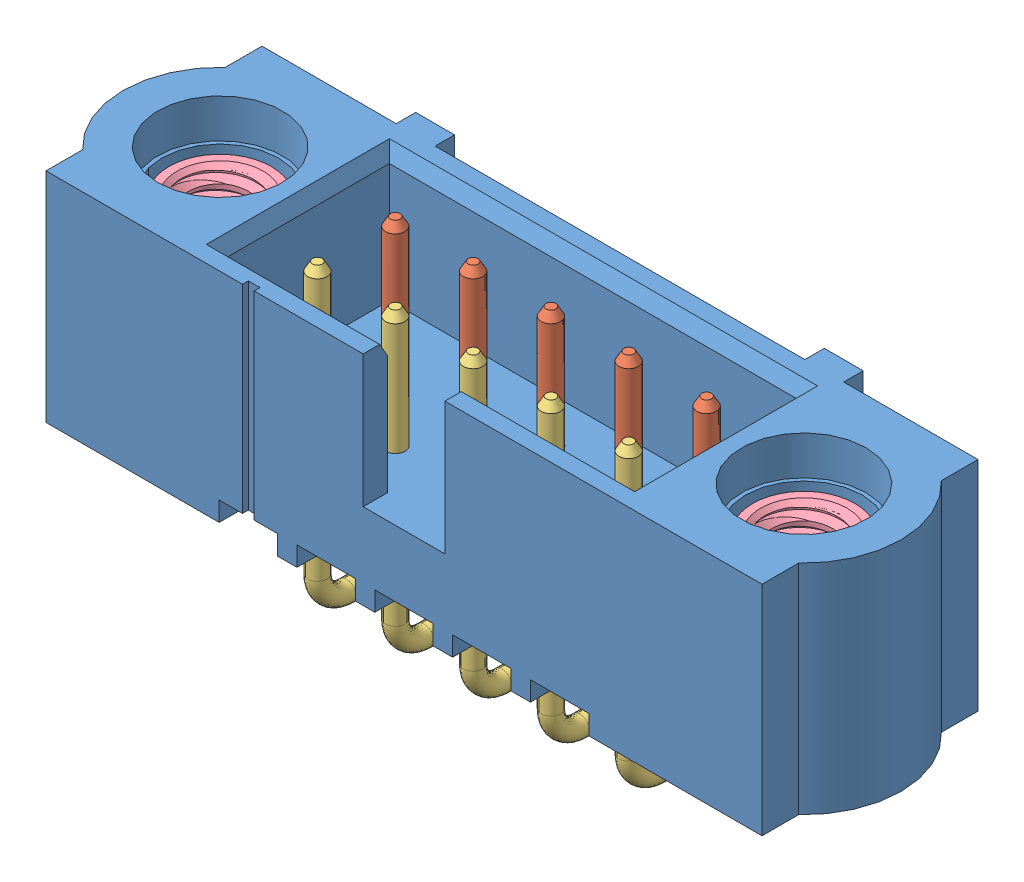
SolidWorks assembly m80-5301042_asm.SLDASM, configuration Default (file format 8000). Lengths in mm.
Overall size (20 8.25 9.06).
13 component instances, 4 part files, 0 mates.
Components (placement in the parent):
- M80-2702098_SEPARATE_ROWS-1: M80-2702098_SEPARATE_ROWS.sldprt [Default] at origin size (20 5.6 6.05)
- M80-530XX22_SHORT_PIN-1: M80-530XX22_SHORT_PIN.sldprt [Default] at (-4 -2.6 -1) x (0 -1 0) z (-1 0 0) size (5.95 5.68 0.8)
- M80-530XX22_SHORT_PIN-2: M80-530XX22_SHORT_PIN.sldprt [Default] at (-2 -2.6 -1) x (0 -1 0) z (-1 0 0) size (5.95 5.68 0.8)
- M80-530XX22_SHORT_PIN-3: M80-530XX22_SHORT_PIN.sldprt [Default] at (0 -2.6 -1) x (0 -1 0) z (-1 0 0) size (5.95 5.68 0.8)
- M80-530XX22_SHORT_PIN-4: M80-530XX22_SHORT_PIN.sldprt [Default] at (2 -2.6 -1) x (0 -1 0) z (-1 0 0) size (5.95 5.68 0.8)
- M80-530XX22_SHORT_PIN-5: M80-530XX22_SHORT_PIN.sldprt [Default] at (4 -2.6 -1) x (0 -1 0) z (-1 0 0) size (5.95 5.68 0.8)
- M80-530XX22_LONG_PIN-1: M80-530XX22_LONG_PIN.sldprt [Default] at (-4 -4.6 1) x (0 -1 0) z (-1 0 0) size (7.95 7.68 0.8)
- M80-530XX22_LONG_PIN-2: M80-530XX22_LONG_PIN.sldprt [Default] at (-2 -4.6 1) x (0 -1 0) z (-1 0 0) size (7.95 7.68 0.8)
- M80-530XX22_LONG_PIN-3: M80-530XX22_LONG_PIN.sldprt [Default] at (0 -4.6 1) x (0 -1 0) z (-1 0 0) size (7.95 7.68 0.8)
- M80-530XX22_LONG_PIN-4: M80-530XX22_LONG_PIN.sldprt [Default] at (2 -4.6 1) x (0 -1 0) z (-1 0 0) size (7.95 7.68 0.8)
- M80-530XX22_LONG_PIN-5: M80-530XX22_LONG_PIN.sldprt [Default] at (4 -4.6 1) x (0 -1 0) z (-1 0 0) size (7.95 7.68 0.8)
- M80-210-1: M80-210.sldprt [Default] at (7.5 -2.2 0) size (3 4.5 3)
- M80-210-2: M80-210.sldprt [Default] at (-7.5 -2.2 0) size (3 4.5 3)
